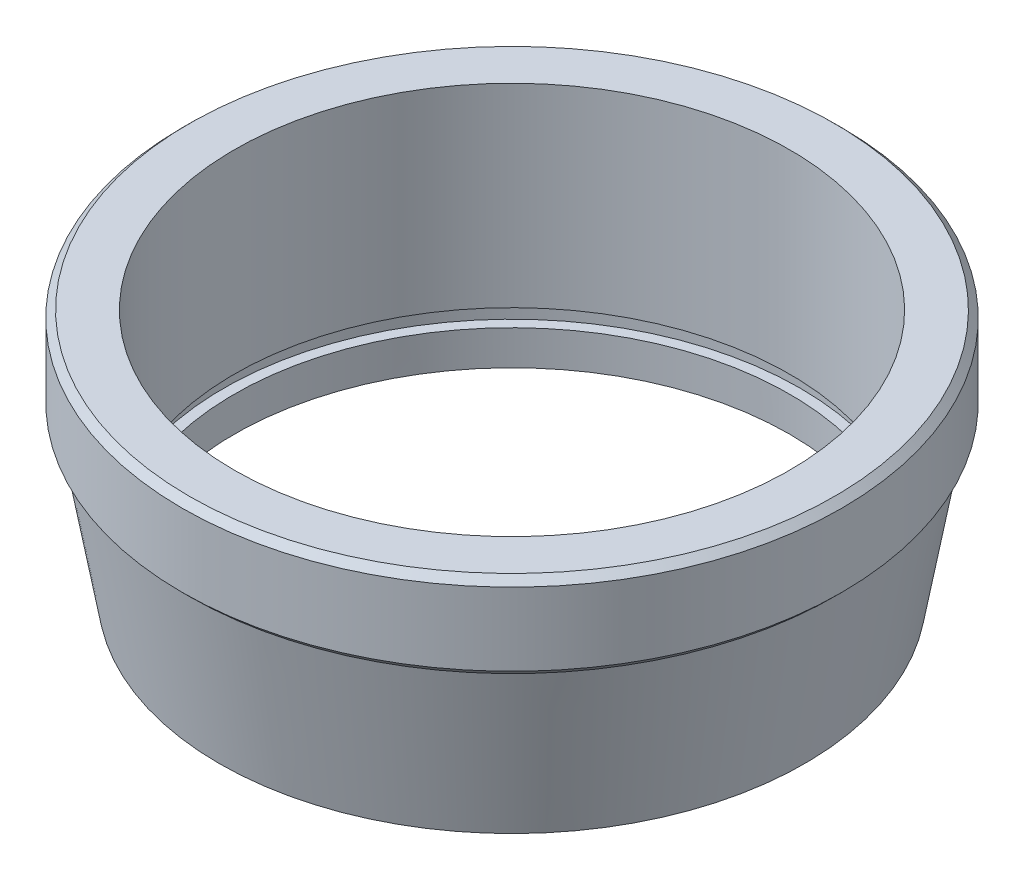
ISO-10303-21;
HEADER;
FILE_DESCRIPTION(('STEP AP214'),'2;1');
FILE_NAME('part.step','',(''),(''),'','','');
FILE_SCHEMA(('AUTOMOTIVE_DESIGN { 1 0 10303 214 1 1 1 1 }'));
ENDSEC;
DATA;
#1=APPLICATION_CONTEXT('core data for automotive mechanical design processes');
#2=APPLICATION_PROTOCOL_DEFINITION('international standard','automotive_design',2000,#1);
#3=PRODUCT_CONTEXT('',#1,'mechanical');
#4=PRODUCT('Part','Part','',(#3));
#5=PRODUCT_RELATED_PRODUCT_CATEGORY('part','',(#4));
#6=PRODUCT_DEFINITION_FORMATION('','',#4);
#7=PRODUCT_DEFINITION_CONTEXT('part definition',#1,'design');
#8=PRODUCT_DEFINITION('design','',#6,#7);
#9=PRODUCT_DEFINITION_SHAPE('','',#8);
#10=(LENGTH_UNIT() NAMED_UNIT(*) SI_UNIT(.MILLI.,.METRE.));
#11=(NAMED_UNIT(*) PLANE_ANGLE_UNIT() SI_UNIT($,.RADIAN.));
#12=(NAMED_UNIT(*) SI_UNIT($,.STERADIAN.) SOLID_ANGLE_UNIT());
#13=UNCERTAINTY_MEASURE_WITH_UNIT(LENGTH_MEASURE(1.E-05),#10,'distance_accuracy_value','');
#14=(GEOMETRIC_REPRESENTATION_CONTEXT(3) GLOBAL_UNCERTAINTY_ASSIGNED_CONTEXT((#13)) GLOBAL_UNIT_ASSIGNED_CONTEXT((#10,
#11,#12)) REPRESENTATION_CONTEXT('',''));
#15=CARTESIAN_POINT('',(0.,0.,0.));
#16=DIRECTION('',(0.,0.,1.));
#17=DIRECTION('',(1.,0.,0.));
#18=AXIS2_PLACEMENT_3D('',#15,#16,#17);
#19=CARTESIAN_POINT('',(0.,0.,0.));
#20=DIRECTION('',(0.,1.,0.));
#21=DIRECTION('',(0.,0.,1.));
#22=AXIS2_PLACEMENT_3D('',#19,#20,#21);
#23=CYLINDRICAL_SURFACE('',#22,8.);
#24=CARTESIAN_POINT('',(0.,-3.1,0.));
#25=DIRECTION('',(0.,1.,0.));
#26=DIRECTION('',(0.,0.,1.));
#27=AXIS2_PLACEMENT_3D('',#24,#25,#26);
#28=CIRCLE('',#27,8.);
#29=CARTESIAN_POINT('',(0.,-3.1,8.));
#30=VERTEX_POINT('',#29);
#31=EDGE_CURVE('E68',#30,#30,#28,.T.);
#32=ORIENTED_EDGE('',*,*,#31,.F.);
#33=EDGE_LOOP('',(#32));
#34=FACE_BOUND('',#33,.T.);
#35=CARTESIAN_POINT('',(0.,2.5,0.));
#36=DIRECTION('',(0.,1.,0.));
#37=DIRECTION('',(0.,0.,1.));
#38=AXIS2_PLACEMENT_3D('',#35,#36,#37);
#39=CIRCLE('',#38,8.);
#40=CARTESIAN_POINT('',(0.,2.5,8.));
#41=VERTEX_POINT('',#40);
#42=EDGE_CURVE('E59',#41,#41,#39,.T.);
#43=ORIENTED_EDGE('',*,*,#42,.T.);
#44=EDGE_LOOP('',(#43));
#45=FACE_BOUND('',#44,.T.);
#46=ADVANCED_FACE('F33',(#34,#45),#23,.F.);
#47=CARTESIAN_POINT('',(0.,0.,0.));
#48=DIRECTION('',(0.,1.,0.));
#49=DIRECTION('',(0.,0.,1.));
#50=AXIS2_PLACEMENT_3D('',#47,#48,#49);
#51=CONICAL_SURFACE('',#50,9.25,0.174532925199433);
#52=CARTESIAN_POINT('',(0.,-4.6,0.));
#53=DIRECTION('',(0.,1.,0.));
#54=DIRECTION('',(0.,0.,1.));
#55=AXIS2_PLACEMENT_3D('',#52,#53,#54);
#56=CIRCLE('',#55,8.43889588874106);
#57=CARTESIAN_POINT('',(0.,-4.6,8.43889588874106));
#58=VERTEX_POINT('',#57);
#59=EDGE_CURVE('E53',#58,#58,#56,.T.);
#60=ORIENTED_EDGE('',*,*,#59,.T.);
#61=EDGE_LOOP('',(#60));
#62=FACE_BOUND('',#61,.T.);
#63=CARTESIAN_POINT('',(0.,0.,0.));
#64=DIRECTION('',(0.,1.,0.));
#65=DIRECTION('',(0.,0.,1.));
#66=AXIS2_PLACEMENT_3D('',#63,#64,#65);
#67=CIRCLE('',#66,9.25);
#68=CARTESIAN_POINT('',(0.,0.,9.25));
#69=VERTEX_POINT('',#68);
#70=EDGE_CURVE('E56',#69,#69,#67,.T.);
#71=ORIENTED_EDGE('',*,*,#70,.F.);
#72=EDGE_LOOP('',(#71));
#73=FACE_BOUND('',#72,.T.);
#74=ADVANCED_FACE('F95',(#62,#73),#51,.T.);
#75=CARTESIAN_POINT('',(0.,-4.6,0.));
#76=DIRECTION('',(0.,1.,0.));
#77=DIRECTION('',(0.,0.,1.));
#78=AXIS2_PLACEMENT_3D('',#75,#76,#77);
#79=PLANE('',#78);
#80=CARTESIAN_POINT('',(0.,-4.6,0.));
#81=DIRECTION('',(0.,-1.,0.));
#82=DIRECTION('',(0.,0.,-1.));
#83=AXIS2_PLACEMENT_3D('',#80,#81,#82);
#84=CIRCLE('',#83,8.);
#85=CARTESIAN_POINT('',(0.,-4.6,-8.));
#86=VERTEX_POINT('',#85);
#87=EDGE_CURVE('E62',#86,#86,#84,.T.);
#88=ORIENTED_EDGE('',*,*,#87,.F.);
#89=EDGE_LOOP('',(#88));
#90=FACE_BOUND('',#89,.T.);
#91=ORIENTED_EDGE('',*,*,#59,.F.);
#92=EDGE_LOOP('',(#91));
#93=FACE_BOUND('',#92,.T.);
#94=ADVANCED_FACE('F110',(#90,#93),#79,.F.);
#95=CARTESIAN_POINT('',(0.,2.5,0.));
#96=DIRECTION('',(0.,-1.,0.));
#97=DIRECTION('',(0.,0.,-1.));
#98=AXIS2_PLACEMENT_3D('',#95,#96,#97);
#99=CYLINDRICAL_SURFACE('',#98,9.5);
#100=CARTESIAN_POINT('',(0.,0.199999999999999,0.));
#101=DIRECTION('',(0.,1.,0.));
#102=DIRECTION('',(0.,0.,1.));
#103=AXIS2_PLACEMENT_3D('',#100,#101,#102);
#104=CIRCLE('',#103,9.5);
#105=CARTESIAN_POINT('',(0.,0.199999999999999,9.5));
#106=VERTEX_POINT('',#105);
#107=EDGE_CURVE('E44',#106,#106,#104,.T.);
#108=ORIENTED_EDGE('',*,*,#107,.T.);
#109=EDGE_LOOP('',(#108));
#110=FACE_BOUND('',#109,.T.);
#111=CARTESIAN_POINT('',(0.,2.3,0.));
#112=DIRECTION('',(0.,1.,0.));
#113=DIRECTION('',(0.,0.,1.));
#114=AXIS2_PLACEMENT_3D('',#111,#112,#113);
#115=CIRCLE('',#114,9.5);
#116=CARTESIAN_POINT('',(0.,2.3,9.5));
#117=VERTEX_POINT('',#116);
#118=EDGE_CURVE('E48',#117,#117,#115,.F.);
#119=ORIENTED_EDGE('',*,*,#118,.T.);
#120=EDGE_LOOP('',(#119));
#121=FACE_BOUND('',#120,.T.);
#122=ADVANCED_FACE('F102',(#110,#121),#99,.T.);
#123=CARTESIAN_POINT('',(0.,2.5,0.));
#124=DIRECTION('',(0.,1.,0.));
#125=DIRECTION('',(0.,0.,1.));
#126=AXIS2_PLACEMENT_3D('',#123,#124,#125);
#127=PLANE('',#126);
#128=ORIENTED_EDGE('',*,*,#42,.F.);
#129=EDGE_LOOP('',(#128));
#130=FACE_BOUND('',#129,.T.);
#131=CARTESIAN_POINT('',(0.,2.5,0.));
#132=DIRECTION('',(0.,1.,0.));
#133=DIRECTION('',(0.,0.,1.));
#134=AXIS2_PLACEMENT_3D('',#131,#132,#133);
#135=CIRCLE('',#134,9.3);
#136=CARTESIAN_POINT('',(0.,2.5,9.3));
#137=VERTEX_POINT('',#136);
#138=EDGE_CURVE('E10',#137,#137,#135,.T.);
#139=ORIENTED_EDGE('',*,*,#138,.T.);
#140=EDGE_LOOP('',(#139));
#141=FACE_BOUND('',#140,.T.);
#142=ADVANCED_FACE('F99',(#130,#141),#127,.T.);
#143=CARTESIAN_POINT('',(0.,0.,0.));
#144=DIRECTION('',(0.,1.,0.));
#145=DIRECTION('',(0.,0.,1.));
#146=AXIS2_PLACEMENT_3D('',#143,#144,#145);
#147=PLANE('',#146);
#148=CARTESIAN_POINT('',(0.,0.,0.));
#149=DIRECTION('',(0.,1.,0.));
#150=DIRECTION('',(0.,0.,1.));
#151=AXIS2_PLACEMENT_3D('',#148,#149,#150);
#152=CIRCLE('',#151,9.3);
#153=CARTESIAN_POINT('',(0.,0.,9.3));
#154=VERTEX_POINT('',#153);
#155=EDGE_CURVE('E40',#154,#154,#152,.F.);
#156=ORIENTED_EDGE('',*,*,#155,.T.);
#157=EDGE_LOOP('',(#156));
#158=FACE_BOUND('',#157,.T.);
#159=ORIENTED_EDGE('',*,*,#70,.T.);
#160=EDGE_LOOP('',(#159));
#161=FACE_BOUND('',#160,.T.);
#162=ADVANCED_FACE('F101',(#158,#161),#147,.F.);
#163=CARTESIAN_POINT('',(0.,0.199999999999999,0.));
#164=DIRECTION('',(0.,1.,0.));
#165=DIRECTION('',(0.,0.,1.));
#166=AXIS2_PLACEMENT_3D('',#163,#164,#165);
#167=CONICAL_SURFACE('',#166,9.5,0.785398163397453);
#168=ORIENTED_EDGE('',*,*,#155,.F.);
#169=EDGE_LOOP('',(#168));
#170=FACE_BOUND('',#169,.T.);
#171=ORIENTED_EDGE('',*,*,#107,.F.);
#172=EDGE_LOOP('',(#171));
#173=FACE_BOUND('',#172,.T.);
#174=ADVANCED_FACE('F108',(#170,#173),#167,.T.);
#175=CARTESIAN_POINT('',(0.,2.5,0.));
#176=DIRECTION('',(0.,-1.,0.));
#177=DIRECTION('',(0.,0.,-1.));
#178=AXIS2_PLACEMENT_3D('',#175,#176,#177);
#179=CONICAL_SURFACE('',#178,9.3,0.785398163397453);
#180=ORIENTED_EDGE('',*,*,#118,.F.);
#181=EDGE_LOOP('',(#180));
#182=FACE_BOUND('',#181,.T.);
#183=ORIENTED_EDGE('',*,*,#138,.F.);
#184=EDGE_LOOP('',(#183));
#185=FACE_BOUND('',#184,.T.);
#186=ADVANCED_FACE('F35',(#182,#185),#179,.T.);
#187=CARTESIAN_POINT('',(0.,-3.6,0.));
#188=DIRECTION('',(0.,1.,0.));
#189=DIRECTION('',(0.,0.,1.));
#190=AXIS2_PLACEMENT_3D('',#187,#188,#189);
#191=CIRCLE('',#190,8.);
#192=CARTESIAN_POINT('',(0.,-3.6,8.));
#193=VERTEX_POINT('',#192);
#194=EDGE_CURVE('E71',#193,#193,#191,.T.);
#195=ORIENTED_EDGE('',*,*,#194,.T.);
#196=EDGE_LOOP('',(#195));
#197=FACE_BOUND('',#196,.T.);
#198=ORIENTED_EDGE('',*,*,#87,.T.);
#199=EDGE_LOOP('',(#198));
#200=FACE_BOUND('',#199,.T.);
#201=ADVANCED_FACE('F84',(#197,#200),#23,.F.);
#202=CARTESIAN_POINT('',(0.,2.5,0.));
#203=DIRECTION('',(0.,1.,0.));
#204=DIRECTION('',(0.,0.,1.));
#205=AXIS2_PLACEMENT_3D('',#202,#203,#204);
#206=CYLINDRICAL_SURFACE('',#205,8.3);
#207=CARTESIAN_POINT('',(0.,-3.6,0.));
#208=DIRECTION('',(0.,1.,0.));
#209=DIRECTION('',(0.,0.,1.));
#210=AXIS2_PLACEMENT_3D('',#207,#208,#209);
#211=CIRCLE('',#210,8.3);
#212=CARTESIAN_POINT('',(0.,-3.6,8.3));
#213=VERTEX_POINT('',#212);
#214=EDGE_CURVE('E74',#213,#213,#211,.T.);
#215=ORIENTED_EDGE('',*,*,#214,.F.);
#216=EDGE_LOOP('',(#215));
#217=FACE_BOUND('',#216,.T.);
#218=CARTESIAN_POINT('',(0.,-3.1,0.));
#219=DIRECTION('',(0.,1.,0.));
#220=DIRECTION('',(0.,0.,1.));
#221=AXIS2_PLACEMENT_3D('',#218,#219,#220);
#222=CIRCLE('',#221,8.3);
#223=CARTESIAN_POINT('',(0.,-3.1,8.3));
#224=VERTEX_POINT('',#223);
#225=EDGE_CURVE('E65',#224,#224,#222,.T.);
#226=ORIENTED_EDGE('',*,*,#225,.T.);
#227=EDGE_LOOP('',(#226));
#228=FACE_BOUND('',#227,.T.);
#229=ADVANCED_FACE('F80',(#217,#228),#206,.F.);
#230=CARTESIAN_POINT('',(-8.3,-3.1,0.));
#231=DIRECTION('',(0.,1.,0.));
#232=DIRECTION('',(0.,0.,1.));
#233=AXIS2_PLACEMENT_3D('',#230,#231,#232);
#234=PLANE('',#233);
#235=ORIENTED_EDGE('',*,*,#225,.F.);
#236=EDGE_LOOP('',(#235));
#237=FACE_BOUND('',#236,.T.);
#238=ORIENTED_EDGE('',*,*,#31,.T.);
#239=EDGE_LOOP('',(#238));
#240=FACE_BOUND('',#239,.T.);
#241=ADVANCED_FACE('F83',(#237,#240),#234,.F.);
#242=CARTESIAN_POINT('',(-8.3,-3.6,0.));
#243=DIRECTION('',(0.,-1.,0.));
#244=DIRECTION('',(0.,0.,-1.));
#245=AXIS2_PLACEMENT_3D('',#242,#243,#244);
#246=PLANE('',#245);
#247=ORIENTED_EDGE('',*,*,#194,.F.);
#248=EDGE_LOOP('',(#247));
#249=FACE_BOUND('',#248,.T.);
#250=ORIENTED_EDGE('',*,*,#214,.T.);
#251=EDGE_LOOP('',(#250));
#252=FACE_BOUND('',#251,.T.);
#253=ADVANCED_FACE('F78',(#249,#252),#246,.F.);
#254=CLOSED_SHELL('',(#46,#74,#94,#122,#142,#162,#174,#186,#201,#229,#241,#253));
#255=MANIFOLD_SOLID_BREP('B2',#254);
#256=ADVANCED_BREP_SHAPE_REPRESENTATION('',(#18,#255),#14);
#257=SHAPE_DEFINITION_REPRESENTATION(#9,#256);
ENDSEC;
END-ISO-10303-21;
